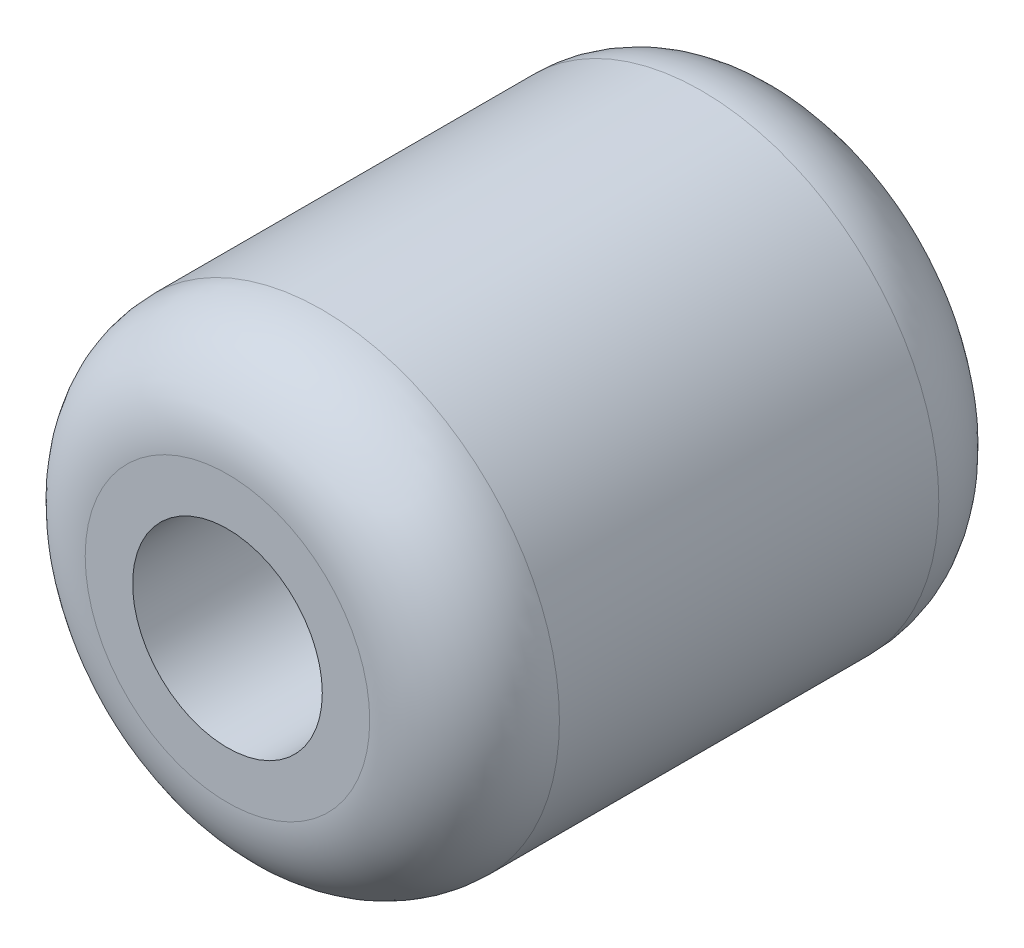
ISO-10303-21;
HEADER;
FILE_DESCRIPTION(('STEP AP214'),'2;1');
FILE_NAME('part.step','',(''),(''),'','','');
FILE_SCHEMA(('AUTOMOTIVE_DESIGN { 1 0 10303 214 1 1 1 1 }'));
ENDSEC;
DATA;
#1=APPLICATION_CONTEXT('core data for automotive mechanical design processes');
#2=APPLICATION_PROTOCOL_DEFINITION('international standard','automotive_design',2000,#1);
#3=PRODUCT_CONTEXT('',#1,'mechanical');
#4=PRODUCT('Part','Part','',(#3));
#5=PRODUCT_RELATED_PRODUCT_CATEGORY('part','',(#4));
#6=PRODUCT_DEFINITION_FORMATION('','',#4);
#7=PRODUCT_DEFINITION_CONTEXT('part definition',#1,'design');
#8=PRODUCT_DEFINITION('design','',#6,#7);
#9=PRODUCT_DEFINITION_SHAPE('','',#8);
#10=(LENGTH_UNIT() NAMED_UNIT(*) SI_UNIT(.MILLI.,.METRE.));
#11=(NAMED_UNIT(*) PLANE_ANGLE_UNIT() SI_UNIT($,.RADIAN.));
#12=(NAMED_UNIT(*) SI_UNIT($,.STERADIAN.) SOLID_ANGLE_UNIT());
#13=UNCERTAINTY_MEASURE_WITH_UNIT(LENGTH_MEASURE(1.E-05),#10,'distance_accuracy_value','');
#14=(GEOMETRIC_REPRESENTATION_CONTEXT(3) GLOBAL_UNCERTAINTY_ASSIGNED_CONTEXT((#13)) GLOBAL_UNIT_ASSIGNED_CONTEXT((#10,
#11,#12)) REPRESENTATION_CONTEXT('',''));
#15=CARTESIAN_POINT('',(0.,0.,0.));
#16=DIRECTION('',(0.,0.,1.));
#17=DIRECTION('',(1.,0.,0.));
#18=AXIS2_PLACEMENT_3D('',#15,#16,#17);
#19=CARTESIAN_POINT('',(0.,0.,6.));
#20=DIRECTION('',(0.,0.,1.));
#21=DIRECTION('',(1.,0.,0.));
#22=AXIS2_PLACEMENT_3D('',#19,#20,#21);
#23=PLANE('',#22);
#24=CARTESIAN_POINT('',(0.,0.,6.));
#25=DIRECTION('',(0.,0.,1.));
#26=DIRECTION('',(1.,0.,0.));
#27=AXIS2_PLACEMENT_3D('',#24,#25,#26);
#28=CIRCLE('',#27,1.5);
#29=CARTESIAN_POINT('',(1.5,0.,6.));
#30=VERTEX_POINT('',#29);
#31=EDGE_CURVE('E50',#30,#30,#28,.T.);
#32=ORIENTED_EDGE('',*,*,#31,.T.);
#33=EDGE_LOOP('',(#32));
#34=FACE_BOUND('',#33,.T.);
#35=CARTESIAN_POINT('',(0.,0.,6.));
#36=DIRECTION('',(0.,0.,1.));
#37=DIRECTION('',(1.,0.,0.));
#38=AXIS2_PLACEMENT_3D('',#35,#36,#37);
#39=CIRCLE('',#38,1.);
#40=CARTESIAN_POINT('',(1.,0.,6.));
#41=VERTEX_POINT('',#40);
#42=EDGE_CURVE('E55',#41,#41,#39,.T.);
#43=ORIENTED_EDGE('',*,*,#42,.F.);
#44=EDGE_LOOP('',(#43));
#45=FACE_BOUND('',#44,.T.);
#46=ADVANCED_FACE('F35',(#34,#45),#23,.T.);
#47=CARTESIAN_POINT('',(0.,0.,0.));
#48=DIRECTION('',(0.,0.,1.));
#49=DIRECTION('',(1.,0.,0.));
#50=AXIS2_PLACEMENT_3D('',#47,#48,#49);
#51=PLANE('',#50);
#52=CARTESIAN_POINT('',(0.,0.,0.));
#53=DIRECTION('',(0.,0.,1.));
#54=DIRECTION('',(1.,0.,0.));
#55=AXIS2_PLACEMENT_3D('',#52,#53,#54);
#56=CIRCLE('',#55,1.5);
#57=CARTESIAN_POINT('',(1.5,0.,0.));
#58=VERTEX_POINT('',#57);
#59=EDGE_CURVE('E10',#58,#58,#56,.F.);
#60=ORIENTED_EDGE('',*,*,#59,.T.);
#61=EDGE_LOOP('',(#60));
#62=FACE_BOUND('',#61,.T.);
#63=CARTESIAN_POINT('',(0.,0.,0.));
#64=DIRECTION('',(0.,0.,1.));
#65=DIRECTION('',(1.,0.,0.));
#66=AXIS2_PLACEMENT_3D('',#63,#64,#65);
#67=CIRCLE('',#66,1.);
#68=CARTESIAN_POINT('',(1.,0.,0.));
#69=VERTEX_POINT('',#68);
#70=EDGE_CURVE('E58',#69,#69,#67,.T.);
#71=ORIENTED_EDGE('',*,*,#70,.T.);
#72=EDGE_LOOP('',(#71));
#73=FACE_BOUND('',#72,.T.);
#74=ADVANCED_FACE('F62',(#62,#73),#51,.F.);
#75=CARTESIAN_POINT('',(0.,0.,6.));
#76=DIRECTION('',(0.,0.,-1.));
#77=DIRECTION('',(-1.,0.,0.));
#78=AXIS2_PLACEMENT_3D('',#75,#76,#77);
#79=CYLINDRICAL_SURFACE('',#78,2.5);
#80=CARTESIAN_POINT('',(0.,0.,5.));
#81=DIRECTION('',(0.,0.,1.));
#82=DIRECTION('',(1.,0.,0.));
#83=AXIS2_PLACEMENT_3D('',#80,#81,#82);
#84=CIRCLE('',#83,2.5);
#85=CARTESIAN_POINT('',(2.5,0.,5.));
#86=VERTEX_POINT('',#85);
#87=EDGE_CURVE('E42',#86,#86,#84,.F.);
#88=ORIENTED_EDGE('',*,*,#87,.T.);
#89=EDGE_LOOP('',(#88));
#90=FACE_BOUND('',#89,.T.);
#91=CARTESIAN_POINT('',(0.,0.,1.));
#92=DIRECTION('',(0.,0.,1.));
#93=DIRECTION('',(1.,0.,0.));
#94=AXIS2_PLACEMENT_3D('',#91,#92,#93);
#95=CIRCLE('',#94,2.5);
#96=CARTESIAN_POINT('',(2.5,0.,1.));
#97=VERTEX_POINT('',#96);
#98=EDGE_CURVE('E46',#97,#97,#95,.T.);
#99=ORIENTED_EDGE('',*,*,#98,.T.);
#100=EDGE_LOOP('',(#99));
#101=FACE_BOUND('',#100,.T.);
#102=ADVANCED_FACE('F37',(#90,#101),#79,.T.);
#103=CARTESIAN_POINT('',(0.,0.,6.));
#104=DIRECTION('',(0.,0.,-1.));
#105=DIRECTION('',(-1.,0.,0.));
#106=AXIS2_PLACEMENT_3D('',#103,#104,#105);
#107=CYLINDRICAL_SURFACE('',#106,1.);
#108=ORIENTED_EDGE('',*,*,#42,.T.);
#109=EDGE_LOOP('',(#108));
#110=FACE_BOUND('',#109,.T.);
#111=ORIENTED_EDGE('',*,*,#70,.F.);
#112=EDGE_LOOP('',(#111));
#113=FACE_BOUND('',#112,.T.);
#114=ADVANCED_FACE('F64',(#110,#113),#107,.F.);
#115=CARTESIAN_POINT('',(0.,0.,5.));
#116=DIRECTION('',(0.,0.,1.));
#117=DIRECTION('',(1.,0.,0.));
#118=AXIS2_PLACEMENT_3D('',#115,#116,#117);
#119=TOROIDAL_SURFACE('',#118,1.5,1.);
#120=ORIENTED_EDGE('',*,*,#87,.F.);
#121=EDGE_LOOP('',(#120));
#122=FACE_BOUND('',#121,.T.);
#123=ORIENTED_EDGE('',*,*,#31,.F.);
#124=EDGE_LOOP('',(#123));
#125=FACE_BOUND('',#124,.T.);
#126=ADVANCED_FACE('F66',(#122,#125),#119,.T.);
#127=CARTESIAN_POINT('',(0.,0.,1.));
#128=DIRECTION('',(0.,0.,1.));
#129=DIRECTION('',(1.,0.,0.));
#130=AXIS2_PLACEMENT_3D('',#127,#128,#129);
#131=TOROIDAL_SURFACE('',#130,1.5,1.);
#132=ORIENTED_EDGE('',*,*,#59,.F.);
#133=EDGE_LOOP('',(#132));
#134=FACE_BOUND('',#133,.T.);
#135=ORIENTED_EDGE('',*,*,#98,.F.);
#136=EDGE_LOOP('',(#135));
#137=FACE_BOUND('',#136,.T.);
#138=ADVANCED_FACE('F73',(#134,#137),#131,.T.);
#139=CLOSED_SHELL('',(#46,#74,#102,#114,#126,#138));
#140=MANIFOLD_SOLID_BREP('B2',#139);
#141=ADVANCED_BREP_SHAPE_REPRESENTATION('',(#18,#140),#14);
#142=SHAPE_DEFINITION_REPRESENTATION(#9,#141);
ENDSEC;
END-ISO-10303-21;
